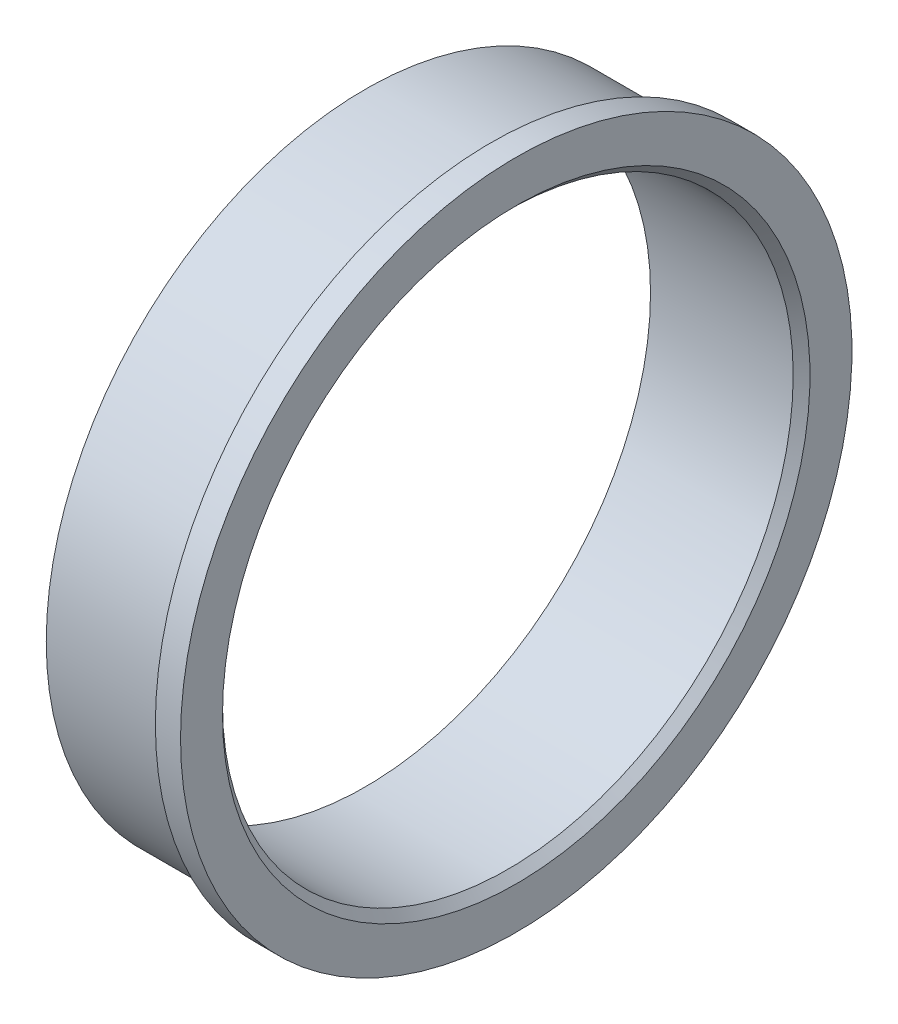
from build123d import *


with BuildPart() as part:
    # Esquisse1 → R_volution1 (revolve)
    with BuildSketch(Plane.XY, mode=Mode.PRIVATE) as r_volution1_sk:
        Polygon((0, 17), (8.5, 17), (9, 17.5), (9, 20), (7.5, 20), (7.5, 19), (0, 19), align=None)
    revolve(r_volution1_sk.sketch.rotate(Axis((0, 0, 0), (1, 0, 0)), 90), axis=Axis((0, 0, 0), (1, 0, 0)))


solid = part.part
